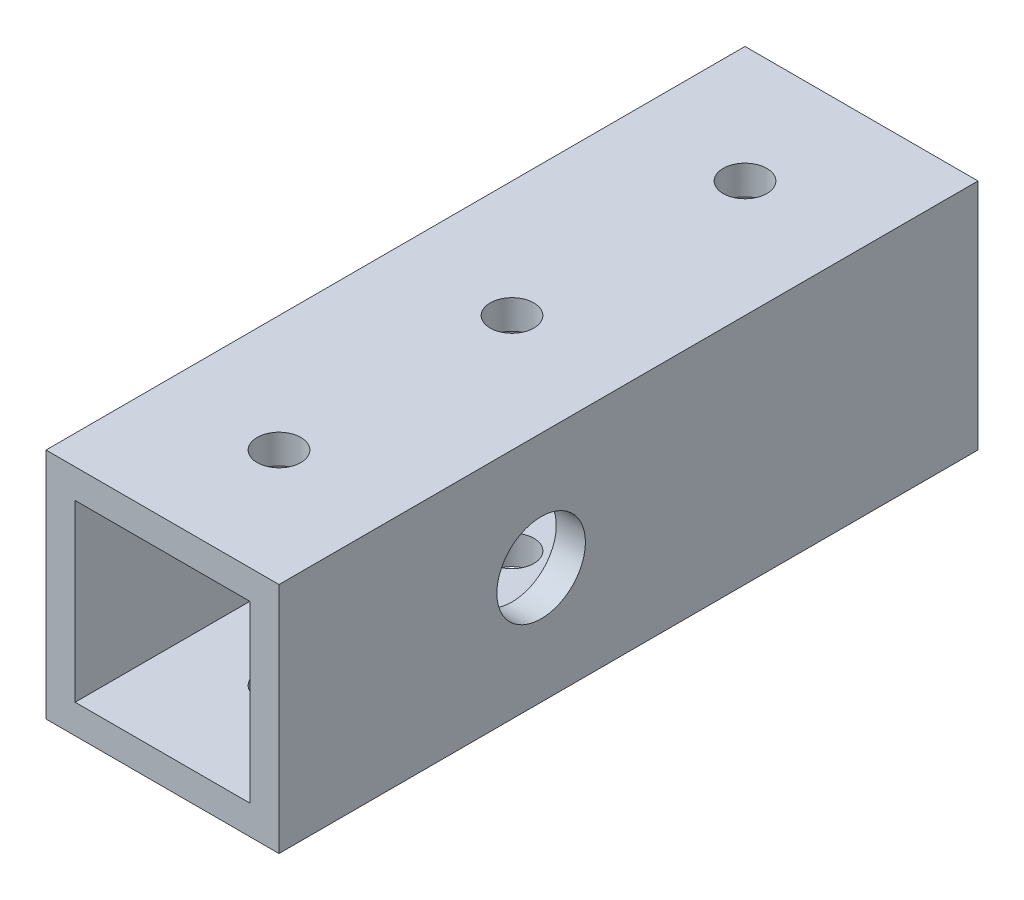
from build123d import *

# Parameters (mm, degrees)
SKETCH1_W               = 25.4
SKETCH1_H               = 25.4
SKETCH1_W_2             = 19.05
SKETCH1_H_2             = 19.05
BOSS_EXTRUDE1_DEPTH     = 38.1
SKETCH2_R               = 4.826
CUT_EXTRUDE1_DEPTH      = 11.43
SKETCH3_R               = 2.38125
CUT_EXTRUDE2_DEPTH      = 48.519048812
LPATTERN1_COUNT         = 3
LPATTERN1_PITCH         = 25.4
CUT_EXTRUDE3_DEPTH      = 6.858
CUT_EXTRUDE3_DEPTH_BACK = 60.452
SKETCH4_R               = 3.556


with BuildPart() as part:
    # Sketch1 → Boss-Extrude1 (new, symmetric)
    with BuildSketch(Plane.XY):
        Rectangle(SKETCH1_W, SKETCH1_H)
        Rectangle(SKETCH1_W_2, SKETCH1_H_2, mode=Mode.SUBTRACT)
    extrude(amount=BOSS_EXTRUDE1_DEPTH, both=True)

    # Sketch2 → Cut-Extrude1 (cut)
    with BuildSketch(Plane(origin=(12.7, 0, 0), x_dir=(0, 0, -1), z_dir=(1, 0, 0))):
        with Locations(Location((-9.525, 0, 0), (0, 0, 90))):
            Circle(SKETCH2_R)
    extrude(amount=-CUT_EXTRUDE1_DEPTH, mode=Mode.SUBTRACT)

    # Sketch3 → Cut-Extrude2 (cut, through all)
    with BuildSketch(Plane.XZ.offset(12.7)):
        with Locations(Location((0, 25.4, 0), (0, 0, 270))):
            Circle(SKETCH3_R)
    cut_extrude2 = extrude(amount=-CUT_EXTRUDE2_DEPTH, mode=Mode.SUBTRACT)

    # LPattern1: Cut-Extrude2 ×3
    with Locations(*[(0, 0, -i * LPATTERN1_PITCH) for i in range(1, LPATTERN1_COUNT)]):
        add(cut_extrude2, mode=Mode.SUBTRACT)

    # Sketch4 → Cut-Extrude3 (cut, two sides: drawn at the far end of the back side and taken through both)
    with BuildSketch(Plane(origin=(-9.525, 0, 0), x_dir=(0, 0, -1), z_dir=(1, 0, 0)).offset(-CUT_EXTRUDE3_DEPTH_BACK)):
        with Locations(Location((-9.525, 0, 0), (0, 0, 90))):
            Circle(SKETCH4_R)
    extrude(amount=CUT_EXTRUDE3_DEPTH + CUT_EXTRUDE3_DEPTH_BACK, mode=Mode.SUBTRACT)


solid = part.part
